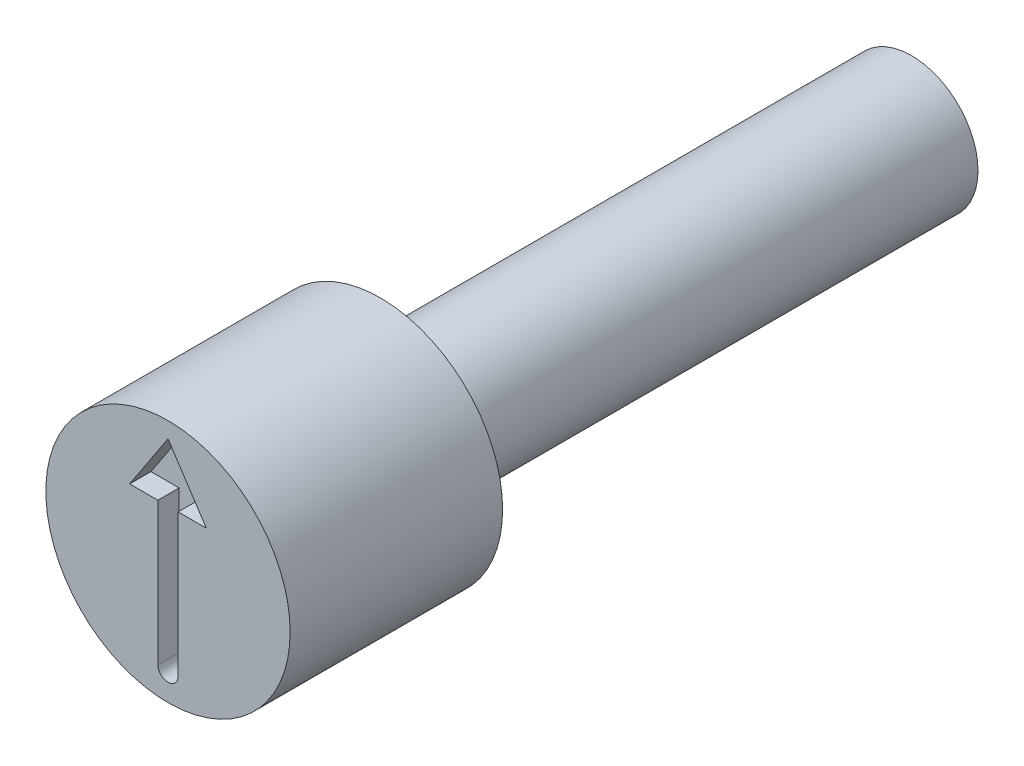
ISO-10303-21;
HEADER;
FILE_DESCRIPTION(('STEP AP214'),'2;1');
FILE_NAME('part.step','',(''),(''),'','','');
FILE_SCHEMA(('AUTOMOTIVE_DESIGN { 1 0 10303 214 1 1 1 1 }'));
ENDSEC;
DATA;
#1=APPLICATION_CONTEXT('core data for automotive mechanical design processes');
#2=APPLICATION_PROTOCOL_DEFINITION('international standard','automotive_design',2000,#1);
#3=PRODUCT_CONTEXT('',#1,'mechanical');
#4=PRODUCT('Part','Part','',(#3));
#5=PRODUCT_RELATED_PRODUCT_CATEGORY('part','',(#4));
#6=PRODUCT_DEFINITION_FORMATION('','',#4);
#7=PRODUCT_DEFINITION_CONTEXT('part definition',#1,'design');
#8=PRODUCT_DEFINITION('design','',#6,#7);
#9=PRODUCT_DEFINITION_SHAPE('','',#8);
#10=(LENGTH_UNIT() NAMED_UNIT(*) SI_UNIT(.MILLI.,.METRE.));
#11=(NAMED_UNIT(*) PLANE_ANGLE_UNIT() SI_UNIT($,.RADIAN.));
#12=(NAMED_UNIT(*) SI_UNIT($,.STERADIAN.) SOLID_ANGLE_UNIT());
#13=UNCERTAINTY_MEASURE_WITH_UNIT(LENGTH_MEASURE(1.E-05),#10,'distance_accuracy_value','');
#14=(GEOMETRIC_REPRESENTATION_CONTEXT(3) GLOBAL_UNCERTAINTY_ASSIGNED_CONTEXT((#13)) GLOBAL_UNIT_ASSIGNED_CONTEXT((#10,
#11,#12)) REPRESENTATION_CONTEXT('',''));
#15=CARTESIAN_POINT('',(0.,0.,0.));
#16=DIRECTION('',(0.,0.,1.));
#17=DIRECTION('',(1.,0.,0.));
#18=AXIS2_PLACEMENT_3D('',#15,#16,#17);
#19=CARTESIAN_POINT('',(0.,1.25,-4.));
#20=DIRECTION('',(0.,0.,1.));
#21=DIRECTION('',(1.,0.,0.));
#22=AXIS2_PLACEMENT_3D('',#19,#20,#21);
#23=PLANE('',#22);
#24=CARTESIAN_POINT('',(0.,0.,-4.));
#25=DIRECTION('',(0.,0.,1.));
#26=DIRECTION('',(1.,0.,0.));
#27=AXIS2_PLACEMENT_3D('',#24,#25,#26);
#28=CIRCLE('',#27,2.3);
#29=CARTESIAN_POINT('',(2.3,0.,-4.));
#30=VERTEX_POINT('',#29);
#31=EDGE_CURVE('E11',#30,#30,#28,.T.);
#32=ORIENTED_EDGE('',*,*,#31,.F.);
#33=EDGE_LOOP('',(#32));
#34=FACE_BOUND('',#33,.T.);
#35=CARTESIAN_POINT('',(0.,0.,-4.));
#36=DIRECTION('',(0.,0.,1.));
#37=DIRECTION('',(1.,0.,0.));
#38=AXIS2_PLACEMENT_3D('',#35,#36,#37);
#39=CIRCLE('',#38,1.25);
#40=CARTESIAN_POINT('',(1.25,0.,-4.));
#41=VERTEX_POINT('',#40);
#42=EDGE_CURVE('E144',#41,#41,#39,.T.);
#43=ORIENTED_EDGE('',*,*,#42,.T.);
#44=EDGE_LOOP('',(#43));
#45=FACE_BOUND('',#44,.T.);
#46=ADVANCED_FACE('F34',(#34,#45),#23,.F.);
#47=CARTESIAN_POINT('',(0.,0.,-0.403888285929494));
#48=DIRECTION('',(0.,0.,1.));
#49=DIRECTION('',(1.,0.,0.));
#50=AXIS2_PLACEMENT_3D('',#47,#48,#49);
#51=CYLINDRICAL_SURFACE('',#50,2.3);
#52=CARTESIAN_POINT('',(0.,0.,0.));
#53=DIRECTION('',(0.,0.,1.));
#54=DIRECTION('',(1.,0.,0.));
#55=AXIS2_PLACEMENT_3D('',#52,#53,#54);
#56=CIRCLE('',#55,2.3);
#57=CARTESIAN_POINT('',(2.3,0.,0.));
#58=VERTEX_POINT('',#57);
#59=EDGE_CURVE('E41',#58,#58,#56,.T.);
#60=ORIENTED_EDGE('',*,*,#59,.F.);
#61=EDGE_LOOP('',(#60));
#62=FACE_BOUND('',#61,.T.);
#63=ORIENTED_EDGE('',*,*,#31,.T.);
#64=EDGE_LOOP('',(#63));
#65=FACE_BOUND('',#64,.T.);
#66=ADVANCED_FACE('F161',(#62,#65),#51,.T.);
#67=CARTESIAN_POINT('',(0.,2.3,0.));
#68=DIRECTION('',(0.,0.,-1.));
#69=DIRECTION('',(-1.,0.,0.));
#70=AXIS2_PLACEMENT_3D('',#67,#68,#69);
#71=PLANE('',#70);
#72=DIRECTION('',(0.,1.,0.));
#73=VECTOR('',#72,1.);
#74=CARTESIAN_POINT('',(0.190473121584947,0.906351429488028,0.));
#75=LINE('',#74,#73);
#76=CARTESIAN_POINT('',(0.190473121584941,-1.77616183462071,0.));
#77=VERTEX_POINT('',#76);
#78=CARTESIAN_POINT('',(0.190473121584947,0.906351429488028,0.));
#79=VERTEX_POINT('',#78);
#80=EDGE_CURVE('E128',#77,#79,#75,.T.);
#81=ORIENTED_EDGE('',*,*,#80,.F.);
#82=CARTESIAN_POINT('',(1.6342449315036E-13,-1.77616183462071,0.));
#83=DIRECTION('',(0.,0.,1.));
#84=DIRECTION('',(1.,0.,0.));
#85=AXIS2_PLACEMENT_3D('',#82,#83,#84);
#86=CIRCLE('',#85,0.190473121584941);
#87=CARTESIAN_POINT('',(-0.190473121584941,-1.77616183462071,0.));
#88=VERTEX_POINT('',#87);
#89=EDGE_CURVE('E48',#88,#77,#86,.T.);
#90=ORIENTED_EDGE('',*,*,#89,.F.);
#91=DIRECTION('',(0.,-1.,0.));
#92=VECTOR('',#91,1.);
#93=CARTESIAN_POINT('',(-0.190473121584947,0.906351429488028,0.));
#94=LINE('',#93,#92);
#95=CARTESIAN_POINT('',(-0.190473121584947,0.906351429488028,0.));
#96=VERTEX_POINT('',#95);
#97=EDGE_CURVE('E140',#96,#88,#94,.T.);
#98=ORIENTED_EDGE('',*,*,#97,.F.);
#99=DIRECTION('',(1.,0.,0.));
#100=VECTOR('',#99,1.);
#101=CARTESIAN_POINT('',(-0.721917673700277,0.906351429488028,0.));
#102=LINE('',#101,#100);
#103=CARTESIAN_POINT('',(-0.721917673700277,0.906351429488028,0.));
#104=VERTEX_POINT('',#103);
#105=EDGE_CURVE('E138',#104,#96,#102,.T.);
#106=ORIENTED_EDGE('',*,*,#105,.F.);
#107=DIRECTION('',(-0.550159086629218,-0.835059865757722,0.));
#108=VECTOR('',#107,1.);
#109=CARTESIAN_POINT('',(0.,2.00211534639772,0.));
#110=LINE('',#109,#108);
#111=CARTESIAN_POINT('',(0.,2.00211534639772,0.));
#112=VERTEX_POINT('',#111);
#113=EDGE_CURVE('E102',#112,#104,#110,.T.);
#114=ORIENTED_EDGE('',*,*,#113,.F.);
#115=DIRECTION('',(-0.550159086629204,0.835059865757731,0.));
#116=VECTOR('',#115,1.);
#117=CARTESIAN_POINT('',(0.,2.00211534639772,0.));
#118=LINE('',#117,#116);
#119=CARTESIAN_POINT('',(0.721917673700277,0.906351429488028,0.));
#120=VERTEX_POINT('',#119);
#121=EDGE_CURVE('E134',#120,#112,#118,.T.);
#122=ORIENTED_EDGE('',*,*,#121,.F.);
#123=DIRECTION('',(1.,0.,0.));
#124=VECTOR('',#123,1.);
#125=CARTESIAN_POINT('',(0.721917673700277,0.906351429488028,0.));
#126=LINE('',#125,#124);
#127=EDGE_CURVE('E131',#79,#120,#126,.T.);
#128=ORIENTED_EDGE('',*,*,#127,.F.);
#129=EDGE_LOOP('',(#81,#90,#98,#106,#114,#122,#128));
#130=FACE_BOUND('',#129,.T.);
#131=ORIENTED_EDGE('',*,*,#59,.T.);
#132=EDGE_LOOP('',(#131));
#133=FACE_BOUND('',#132,.T.);
#134=ADVANCED_FACE('F159',(#130,#133),#71,.F.);
#135=CARTESIAN_POINT('',(0.,0.,-14.));
#136=DIRECTION('',(0.,0.,1.));
#137=DIRECTION('',(1.,0.,0.));
#138=AXIS2_PLACEMENT_3D('',#135,#136,#137);
#139=PLANE('',#138);
#140=CARTESIAN_POINT('',(0.,0.,-14.));
#141=DIRECTION('',(0.,0.,1.));
#142=DIRECTION('',(1.,0.,0.));
#143=AXIS2_PLACEMENT_3D('',#140,#141,#142);
#144=CIRCLE('',#143,1.25);
#145=CARTESIAN_POINT('',(1.25,0.,-14.));
#146=VERTEX_POINT('',#145);
#147=EDGE_CURVE('E154',#146,#146,#144,.T.);
#148=ORIENTED_EDGE('',*,*,#147,.F.);
#149=EDGE_LOOP('',(#148));
#150=FACE_BOUND('',#149,.T.);
#151=ADVANCED_FACE('F174',(#150),#139,.F.);
#152=CARTESIAN_POINT('',(0.,0.,-0.403888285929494));
#153=DIRECTION('',(0.,0.,1.));
#154=DIRECTION('',(1.,0.,0.));
#155=AXIS2_PLACEMENT_3D('',#152,#153,#154);
#156=CYLINDRICAL_SURFACE('',#155,1.25);
#157=ORIENTED_EDGE('',*,*,#42,.F.);
#158=EDGE_LOOP('',(#157));
#159=FACE_BOUND('',#158,.T.);
#160=ORIENTED_EDGE('',*,*,#147,.T.);
#161=EDGE_LOOP('',(#160));
#162=FACE_BOUND('',#161,.T.);
#163=ADVANCED_FACE('F170',(#159,#162),#156,.T.);
#164=CARTESIAN_POINT('',(1.6342449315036E-13,-1.77616183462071,-0.4));
#165=DIRECTION('',(0.,0.,1.));
#166=DIRECTION('',(1.,0.,0.));
#167=AXIS2_PLACEMENT_3D('',#164,#165,#166);
#168=CYLINDRICAL_SURFACE('',#167,0.190473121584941);
#169=ORIENTED_EDGE('',*,*,#89,.T.);
#170=DIRECTION('',(0.,0.,1.));
#171=VECTOR('',#170,1.);
#172=CARTESIAN_POINT('',(0.190473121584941,-1.77616183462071,-0.4));
#173=LINE('',#172,#171);
#174=CARTESIAN_POINT('',(0.190473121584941,-1.77616183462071,-0.4));
#175=VERTEX_POINT('',#174);
#176=EDGE_CURVE('E81',#175,#77,#173,.T.);
#177=ORIENTED_EDGE('',*,*,#176,.F.);
#178=CARTESIAN_POINT('',(1.6342449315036E-13,-1.77616183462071,-0.4));
#179=DIRECTION('',(0.,0.,1.));
#180=DIRECTION('',(1.,0.,0.));
#181=AXIS2_PLACEMENT_3D('',#178,#179,#180);
#182=CIRCLE('',#181,0.190473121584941);
#183=CARTESIAN_POINT('',(-0.190473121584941,-1.77616183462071,-0.4));
#184=VERTEX_POINT('',#183);
#185=EDGE_CURVE('E142',#184,#175,#182,.T.);
#186=ORIENTED_EDGE('',*,*,#185,.F.);
#187=DIRECTION('',(0.,0.,1.));
#188=VECTOR('',#187,1.);
#189=CARTESIAN_POINT('',(-0.190473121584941,-1.77616183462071,-0.4));
#190=LINE('',#189,#188);
#191=EDGE_CURVE('E56',#184,#88,#190,.T.);
#192=ORIENTED_EDGE('',*,*,#191,.T.);
#193=EDGE_LOOP('',(#169,#177,#186,#192));
#194=FACE_BOUND('',#193,.T.);
#195=ADVANCED_FACE('F173',(#194),#168,.F.);
#196=CARTESIAN_POINT('',(-0.190473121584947,0.906351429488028,-0.4));
#197=DIRECTION('',(-1.,0.,0.));
#198=DIRECTION('',(0.,-1.,0.));
#199=AXIS2_PLACEMENT_3D('',#196,#197,#198);
#200=PLANE('',#199);
#201=ORIENTED_EDGE('',*,*,#97,.T.);
#202=ORIENTED_EDGE('',*,*,#191,.F.);
#203=DIRECTION('',(0.,-1.,0.));
#204=VECTOR('',#203,1.);
#205=CARTESIAN_POINT('',(-0.190473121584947,0.906351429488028,-0.4));
#206=LINE('',#205,#204);
#207=CARTESIAN_POINT('',(-0.190473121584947,0.906351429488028,-0.4));
#208=VERTEX_POINT('',#207);
#209=EDGE_CURVE('E114',#208,#184,#206,.T.);
#210=ORIENTED_EDGE('',*,*,#209,.F.);
#211=DIRECTION('',(0.,0.,1.));
#212=VECTOR('',#211,1.);
#213=CARTESIAN_POINT('',(-0.190473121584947,0.906351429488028,-0.4));
#214=LINE('',#213,#212);
#215=EDGE_CURVE('E106',#208,#96,#214,.T.);
#216=ORIENTED_EDGE('',*,*,#215,.T.);
#217=EDGE_LOOP('',(#201,#202,#210,#216));
#218=FACE_BOUND('',#217,.T.);
#219=ADVANCED_FACE('F188',(#218),#200,.F.);
#220=CARTESIAN_POINT('',(-0.721917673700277,0.906351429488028,-0.4));
#221=DIRECTION('',(0.,-1.,0.));
#222=DIRECTION('',(0.,0.,-1.));
#223=AXIS2_PLACEMENT_3D('',#220,#221,#222);
#224=PLANE('',#223);
#225=ORIENTED_EDGE('',*,*,#105,.T.);
#226=ORIENTED_EDGE('',*,*,#215,.F.);
#227=DIRECTION('',(1.,0.,0.));
#228=VECTOR('',#227,1.);
#229=CARTESIAN_POINT('',(-0.721917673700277,0.906351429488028,-0.4));
#230=LINE('',#229,#228);
#231=CARTESIAN_POINT('',(-0.721917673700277,0.906351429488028,-0.4));
#232=VERTEX_POINT('',#231);
#233=EDGE_CURVE('E110',#232,#208,#230,.T.);
#234=ORIENTED_EDGE('',*,*,#233,.F.);
#235=DIRECTION('',(0.,0.,1.));
#236=VECTOR('',#235,1.);
#237=CARTESIAN_POINT('',(-0.721917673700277,0.906351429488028,-0.4));
#238=LINE('',#237,#236);
#239=EDGE_CURVE('E95',#232,#104,#238,.T.);
#240=ORIENTED_EDGE('',*,*,#239,.T.);
#241=EDGE_LOOP('',(#225,#226,#234,#240));
#242=FACE_BOUND('',#241,.T.);
#243=ADVANCED_FACE('F111',(#242),#224,.F.);
#244=CARTESIAN_POINT('',(0.,2.00211534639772,-0.4));
#245=DIRECTION('',(-0.835059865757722,0.550159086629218,0.));
#246=DIRECTION('',(-0.550159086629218,-0.835059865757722,0.));
#247=AXIS2_PLACEMENT_3D('',#244,#245,#246);
#248=PLANE('',#247);
#249=ORIENTED_EDGE('',*,*,#113,.T.);
#250=ORIENTED_EDGE('',*,*,#239,.F.);
#251=DIRECTION('',(-0.550159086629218,-0.835059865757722,0.));
#252=VECTOR('',#251,1.);
#253=CARTESIAN_POINT('',(0.,2.00211534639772,-0.4));
#254=LINE('',#253,#252);
#255=CARTESIAN_POINT('',(0.,2.00211534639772,-0.4));
#256=VERTEX_POINT('',#255);
#257=EDGE_CURVE('E99',#256,#232,#254,.T.);
#258=ORIENTED_EDGE('',*,*,#257,.F.);
#259=DIRECTION('',(0.,0.,1.));
#260=VECTOR('',#259,1.);
#261=CARTESIAN_POINT('',(0.,2.00211534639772,-0.4));
#262=LINE('',#261,#260);
#263=EDGE_CURVE('E107',#256,#112,#262,.T.);
#264=ORIENTED_EDGE('',*,*,#263,.T.);
#265=EDGE_LOOP('',(#249,#250,#258,#264));
#266=FACE_BOUND('',#265,.T.);
#267=ADVANCED_FACE('F97',(#266),#248,.F.);
#268=CARTESIAN_POINT('',(0.,2.00211534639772,-0.4));
#269=DIRECTION('',(0.835059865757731,0.550159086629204,0.));
#270=DIRECTION('',(-0.550159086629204,0.835059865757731,0.));
#271=AXIS2_PLACEMENT_3D('',#268,#269,#270);
#272=PLANE('',#271);
#273=ORIENTED_EDGE('',*,*,#121,.T.);
#274=ORIENTED_EDGE('',*,*,#263,.F.);
#275=DIRECTION('',(-0.550159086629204,0.835059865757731,0.));
#276=VECTOR('',#275,1.);
#277=CARTESIAN_POINT('',(0.,2.00211534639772,-0.4));
#278=LINE('',#277,#276);
#279=CARTESIAN_POINT('',(0.721917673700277,0.906351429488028,-0.4));
#280=VERTEX_POINT('',#279);
#281=EDGE_CURVE('E120',#280,#256,#278,.T.);
#282=ORIENTED_EDGE('',*,*,#281,.F.);
#283=DIRECTION('',(0.,0.,1.));
#284=VECTOR('',#283,1.);
#285=CARTESIAN_POINT('',(0.721917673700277,0.906351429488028,-0.4));
#286=LINE('',#285,#284);
#287=EDGE_CURVE('E147',#280,#120,#286,.T.);
#288=ORIENTED_EDGE('',*,*,#287,.T.);
#289=EDGE_LOOP('',(#273,#274,#282,#288));
#290=FACE_BOUND('',#289,.T.);
#291=ADVANCED_FACE('F196',(#290),#272,.F.);
#292=CARTESIAN_POINT('',(0.721917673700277,0.906351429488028,-0.4));
#293=DIRECTION('',(0.,-1.,0.));
#294=DIRECTION('',(0.,0.,-1.));
#295=AXIS2_PLACEMENT_3D('',#292,#293,#294);
#296=PLANE('',#295);
#297=ORIENTED_EDGE('',*,*,#127,.T.);
#298=ORIENTED_EDGE('',*,*,#287,.F.);
#299=DIRECTION('',(1.,0.,0.));
#300=VECTOR('',#299,1.);
#301=CARTESIAN_POINT('',(0.721917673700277,0.906351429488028,-0.4));
#302=LINE('',#301,#300);
#303=CARTESIAN_POINT('',(0.190473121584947,0.906351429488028,-0.4));
#304=VERTEX_POINT('',#303);
#305=EDGE_CURVE('E122',#304,#280,#302,.T.);
#306=ORIENTED_EDGE('',*,*,#305,.F.);
#307=DIRECTION('',(0.,0.,1.));
#308=VECTOR('',#307,1.);
#309=CARTESIAN_POINT('',(0.190473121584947,0.906351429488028,-0.4));
#310=LINE('',#309,#308);
#311=EDGE_CURVE('E149',#304,#79,#310,.T.);
#312=ORIENTED_EDGE('',*,*,#311,.T.);
#313=EDGE_LOOP('',(#297,#298,#306,#312));
#314=FACE_BOUND('',#313,.T.);
#315=ADVANCED_FACE('F192',(#314),#296,.F.);
#316=CARTESIAN_POINT('',(0.190473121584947,0.906351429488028,-0.4));
#317=DIRECTION('',(1.,0.,0.));
#318=DIRECTION('',(0.,1.,0.));
#319=AXIS2_PLACEMENT_3D('',#316,#317,#318);
#320=PLANE('',#319);
#321=ORIENTED_EDGE('',*,*,#80,.T.);
#322=ORIENTED_EDGE('',*,*,#311,.F.);
#323=DIRECTION('',(0.,1.,0.));
#324=VECTOR('',#323,1.);
#325=CARTESIAN_POINT('',(0.190473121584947,0.906351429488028,-0.4));
#326=LINE('',#325,#324);
#327=EDGE_CURVE('E290',#175,#304,#326,.T.);
#328=ORIENTED_EDGE('',*,*,#327,.F.);
#329=ORIENTED_EDGE('',*,*,#176,.T.);
#330=EDGE_LOOP('',(#321,#322,#328,#329));
#331=FACE_BOUND('',#330,.T.);
#332=ADVANCED_FACE('F189',(#331),#320,.F.);
#333=CARTESIAN_POINT('',(1.6342449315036E-13,-1.77616183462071,-0.4));
#334=DIRECTION('',(0.,0.,1.));
#335=DIRECTION('',(1.,0.,0.));
#336=AXIS2_PLACEMENT_3D('',#333,#334,#335);
#337=PLANE('',#336);
#338=ORIENTED_EDGE('',*,*,#185,.T.);
#339=ORIENTED_EDGE('',*,*,#327,.T.);
#340=ORIENTED_EDGE('',*,*,#305,.T.);
#341=ORIENTED_EDGE('',*,*,#281,.T.);
#342=ORIENTED_EDGE('',*,*,#257,.T.);
#343=ORIENTED_EDGE('',*,*,#233,.T.);
#344=ORIENTED_EDGE('',*,*,#209,.T.);
#345=EDGE_LOOP('',(#338,#339,#340,#341,#342,#343,#344));
#346=FACE_BOUND('',#345,.T.);
#347=ADVANCED_FACE('F117',(#346),#337,.T.);
#348=CLOSED_SHELL('',(#46,#66,#134,#151,#163,#195,#219,#243,#267,#291,#315,#332,#347));
#349=MANIFOLD_SOLID_BREP('B2',#348);
#350=ADVANCED_BREP_SHAPE_REPRESENTATION('',(#18,#349),#14);
#351=SHAPE_DEFINITION_REPRESENTATION(#9,#350);
ENDSEC;
END-ISO-10303-21;
